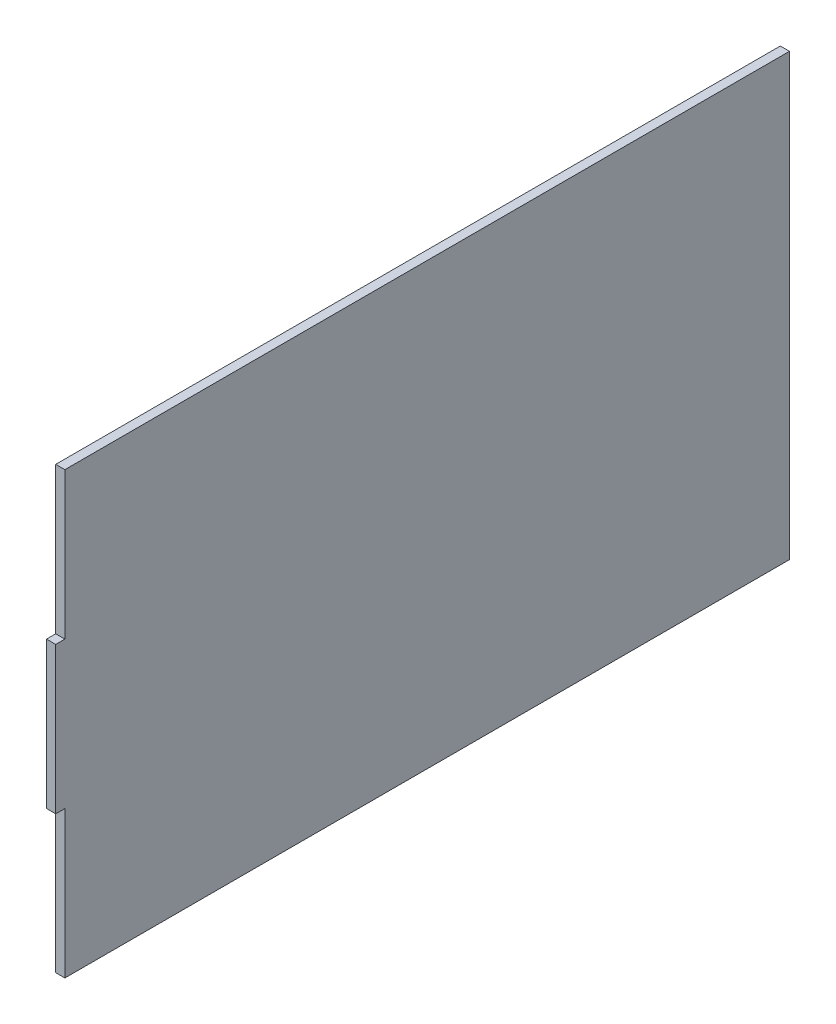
ISO-10303-21;
HEADER;
FILE_DESCRIPTION(('STEP AP214'),'2;1');
FILE_NAME('part.step','',(''),(''),'','','');
FILE_SCHEMA(('AUTOMOTIVE_DESIGN { 1 0 10303 214 1 1 1 1 }'));
ENDSEC;
DATA;
#1=APPLICATION_CONTEXT('core data for automotive mechanical design processes');
#2=APPLICATION_PROTOCOL_DEFINITION('international standard','automotive_design',2000,#1);
#3=PRODUCT_CONTEXT('',#1,'mechanical');
#4=PRODUCT('Part','Part','',(#3));
#5=PRODUCT_RELATED_PRODUCT_CATEGORY('part','',(#4));
#6=PRODUCT_DEFINITION_FORMATION('','',#4);
#7=PRODUCT_DEFINITION_CONTEXT('part definition',#1,'design');
#8=PRODUCT_DEFINITION('design','',#6,#7);
#9=PRODUCT_DEFINITION_SHAPE('','',#8);
#10=(LENGTH_UNIT() NAMED_UNIT(*) SI_UNIT(.MILLI.,.METRE.));
#11=(NAMED_UNIT(*) PLANE_ANGLE_UNIT() SI_UNIT($,.RADIAN.));
#12=(NAMED_UNIT(*) SI_UNIT($,.STERADIAN.) SOLID_ANGLE_UNIT());
#13=UNCERTAINTY_MEASURE_WITH_UNIT(LENGTH_MEASURE(1.E-05),#10,'distance_accuracy_value','');
#14=(GEOMETRIC_REPRESENTATION_CONTEXT(3) GLOBAL_UNCERTAINTY_ASSIGNED_CONTEXT((#13)) GLOBAL_UNIT_ASSIGNED_CONTEXT((#10,
#11,#12)) REPRESENTATION_CONTEXT('',''));
#15=CARTESIAN_POINT('',(0.,0.,0.));
#16=DIRECTION('',(0.,0.,1.));
#17=DIRECTION('',(1.,0.,0.));
#18=AXIS2_PLACEMENT_3D('',#15,#16,#17);
#19=CARTESIAN_POINT('',(1.58749999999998,152.4,-127.));
#20=DIRECTION('',(-1.,0.,0.));
#21=DIRECTION('',(0.,0.,1.));
#22=AXIS2_PLACEMENT_3D('',#19,#20,#21);
#23=PLANE('',#22);
#24=DIRECTION('',(0.,-1.,0.));
#25=VECTOR('',#24,1.);
#26=CARTESIAN_POINT('',(1.58750000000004,152.4,123.825));
#27=LINE('',#26,#25);
#28=CARTESIAN_POINT('',(1.58750000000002,152.4,123.825));
#29=VERTEX_POINT('',#28);
#30=CARTESIAN_POINT('',(1.58750000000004,101.6,123.825));
#31=VERTEX_POINT('',#30);
#32=EDGE_CURVE('E49',#29,#31,#27,.T.);
#33=ORIENTED_EDGE('',*,*,#32,.T.);
#34=DIRECTION('',(0.,0.,1.));
#35=VECTOR('',#34,1.);
#36=CARTESIAN_POINT('',(1.58750000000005,101.6,127.));
#37=LINE('',#36,#35);
#38=CARTESIAN_POINT('',(1.58750000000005,101.6,127.));
#39=VERTEX_POINT('',#38);
#40=EDGE_CURVE('E132',#31,#39,#37,.T.);
#41=ORIENTED_EDGE('',*,*,#40,.T.);
#42=DIRECTION('',(0.,-1.,0.));
#43=VECTOR('',#42,1.);
#44=CARTESIAN_POINT('',(1.58750000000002,152.4,127.));
#45=LINE('',#44,#43);
#46=CARTESIAN_POINT('',(1.58750000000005,50.8,127.));
#47=VERTEX_POINT('',#46);
#48=EDGE_CURVE('E202',#39,#47,#45,.T.);
#49=ORIENTED_EDGE('',*,*,#48,.T.);
#50=DIRECTION('',(0.,0.,-1.));
#51=VECTOR('',#50,1.);
#52=CARTESIAN_POINT('',(1.58750000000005,50.8,127.));
#53=LINE('',#52,#51);
#54=CARTESIAN_POINT('',(1.58750000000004,50.8,123.825));
#55=VERTEX_POINT('',#54);
#56=EDGE_CURVE('E151',#47,#55,#53,.T.);
#57=ORIENTED_EDGE('',*,*,#56,.T.);
#58=DIRECTION('',(0.,-1.,0.));
#59=VECTOR('',#58,1.);
#60=CARTESIAN_POINT('',(1.58750000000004,0.,123.825));
#61=LINE('',#60,#59);
#62=CARTESIAN_POINT('',(1.58750000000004,0.,123.825));
#63=VERTEX_POINT('',#62);
#64=EDGE_CURVE('E154',#55,#63,#61,.T.);
#65=ORIENTED_EDGE('',*,*,#64,.T.);
#66=DIRECTION('',(0.,0.,-1.));
#67=VECTOR('',#66,1.);
#68=CARTESIAN_POINT('',(1.58749999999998,0.,-127.));
#69=LINE('',#68,#67);
#70=CARTESIAN_POINT('',(1.58749999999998,0.,-127.));
#71=VERTEX_POINT('',#70);
#72=EDGE_CURVE('E189',#63,#71,#69,.T.);
#73=ORIENTED_EDGE('',*,*,#72,.T.);
#74=DIRECTION('',(0.,-1.,0.));
#75=VECTOR('',#74,1.);
#76=CARTESIAN_POINT('',(1.58749999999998,152.4,-127.));
#77=LINE('',#76,#75);
#78=CARTESIAN_POINT('',(1.58749999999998,152.4,-127.));
#79=VERTEX_POINT('',#78);
#80=EDGE_CURVE('E11',#79,#71,#77,.T.);
#81=ORIENTED_EDGE('',*,*,#80,.F.);
#82=DIRECTION('',(0.,0.,-1.));
#83=VECTOR('',#82,1.);
#84=CARTESIAN_POINT('',(1.58749999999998,152.4,-127.));
#85=LINE('',#84,#83);
#86=EDGE_CURVE('E141',#29,#79,#85,.T.);
#87=ORIENTED_EDGE('',*,*,#86,.F.);
#88=EDGE_LOOP('',(#33,#41,#49,#57,#65,#73,#81,#87));
#89=FACE_BOUND('',#88,.T.);
#90=ADVANCED_FACE('F35',(#89),#23,.F.);
#91=CARTESIAN_POINT('',(-1.58750000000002,152.4,-127.));
#92=DIRECTION('',(0.,0.,1.));
#93=DIRECTION('',(1.,0.,0.));
#94=AXIS2_PLACEMENT_3D('',#91,#92,#93);
#95=PLANE('',#94);
#96=DIRECTION('',(0.,-1.,0.));
#97=VECTOR('',#96,1.);
#98=CARTESIAN_POINT('',(0.,63.5,-127.));
#99=LINE('',#98,#97);
#100=CARTESIAN_POINT('',(0.,63.5,-127.));
#101=VERTEX_POINT('',#100);
#102=CARTESIAN_POINT('',(0.,38.1,-127.));
#103=VERTEX_POINT('',#102);
#104=EDGE_CURVE('E166',#101,#103,#99,.T.);
#105=ORIENTED_EDGE('',*,*,#104,.F.);
#106=DIRECTION('',(-1.,0.,0.));
#107=VECTOR('',#106,1.);
#108=CARTESIAN_POINT('',(0.,63.5,-127.));
#109=LINE('',#108,#107);
#110=CARTESIAN_POINT('',(-1.58750000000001,63.5,-127.));
#111=VERTEX_POINT('',#110);
#112=EDGE_CURVE('E186',#101,#111,#109,.T.);
#113=ORIENTED_EDGE('',*,*,#112,.T.);
#114=DIRECTION('',(0.,-1.,0.));
#115=VECTOR('',#114,1.);
#116=CARTESIAN_POINT('',(-1.58750000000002,152.4,-127.));
#117=LINE('',#116,#115);
#118=CARTESIAN_POINT('',(-1.58750000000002,152.4,-127.));
#119=VERTEX_POINT('',#118);
#120=EDGE_CURVE('E42',#119,#111,#117,.T.);
#121=ORIENTED_EDGE('',*,*,#120,.F.);
#122=DIRECTION('',(-1.,0.,0.));
#123=VECTOR('',#122,1.);
#124=CARTESIAN_POINT('',(-1.58750000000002,152.4,-127.));
#125=LINE('',#124,#123);
#126=EDGE_CURVE('E196',#79,#119,#125,.T.);
#127=ORIENTED_EDGE('',*,*,#126,.F.);
#128=ORIENTED_EDGE('',*,*,#80,.T.);
#129=DIRECTION('',(-1.,0.,0.));
#130=VECTOR('',#129,1.);
#131=CARTESIAN_POINT('',(-1.58750000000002,0.,-127.));
#132=LINE('',#131,#130);
#133=CARTESIAN_POINT('',(-1.58750000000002,0.,-127.));
#134=VERTEX_POINT('',#133);
#135=EDGE_CURVE('E204',#71,#134,#132,.T.);
#136=ORIENTED_EDGE('',*,*,#135,.T.);
#137=CARTESIAN_POINT('',(-1.58750000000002,38.1,-127.));
#138=VERTEX_POINT('',#137);
#139=EDGE_CURVE('E212',#138,#134,#117,.T.);
#140=ORIENTED_EDGE('',*,*,#139,.F.);
#141=DIRECTION('',(-1.,0.,0.));
#142=VECTOR('',#141,1.);
#143=CARTESIAN_POINT('',(0.,38.1,-127.));
#144=LINE('',#143,#142);
#145=EDGE_CURVE('E179',#103,#138,#144,.T.);
#146=ORIENTED_EDGE('',*,*,#145,.F.);
#147=EDGE_LOOP('',(#105,#113,#121,#127,#128,#136,#140,#146));
#148=FACE_BOUND('',#147,.T.);
#149=ADVANCED_FACE('F228',(#148),#95,.F.);
#150=CARTESIAN_POINT('',(-1.58750000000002,152.4,-127.));
#151=DIRECTION('',(1.,0.,0.));
#152=DIRECTION('',(0.,0.,-1.));
#153=AXIS2_PLACEMENT_3D('',#150,#151,#152);
#154=PLANE('',#153);
#155=DIRECTION('',(0.,-1.,0.));
#156=VECTOR('',#155,1.);
#157=CARTESIAN_POINT('',(-1.58749999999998,152.4,127.));
#158=LINE('',#157,#156);
#159=CARTESIAN_POINT('',(-1.58749999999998,101.6,127.));
#160=VERTEX_POINT('',#159);
#161=CARTESIAN_POINT('',(-1.58749999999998,50.8,127.));
#162=VERTEX_POINT('',#161);
#163=EDGE_CURVE('E210',#160,#162,#158,.T.);
#164=ORIENTED_EDGE('',*,*,#163,.F.);
#165=DIRECTION('',(0.,0.,1.));
#166=VECTOR('',#165,1.);
#167=CARTESIAN_POINT('',(-1.58749999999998,101.6,127.));
#168=LINE('',#167,#166);
#169=CARTESIAN_POINT('',(-1.58749999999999,101.6,123.825));
#170=VERTEX_POINT('',#169);
#171=EDGE_CURVE('E142',#170,#160,#168,.T.);
#172=ORIENTED_EDGE('',*,*,#171,.F.);
#173=DIRECTION('',(0.,-1.,0.));
#174=VECTOR('',#173,1.);
#175=CARTESIAN_POINT('',(-1.58749999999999,152.4,123.825));
#176=LINE('',#175,#174);
#177=CARTESIAN_POINT('',(-1.58749999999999,152.4,123.825));
#178=VERTEX_POINT('',#177);
#179=EDGE_CURVE('E125',#178,#170,#176,.T.);
#180=ORIENTED_EDGE('',*,*,#179,.F.);
#181=DIRECTION('',(0.,0.,1.));
#182=VECTOR('',#181,1.);
#183=CARTESIAN_POINT('',(-1.58750000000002,152.4,-127.));
#184=LINE('',#183,#182);
#185=EDGE_CURVE('E199',#119,#178,#184,.T.);
#186=ORIENTED_EDGE('',*,*,#185,.F.);
#187=ORIENTED_EDGE('',*,*,#120,.T.);
#188=DIRECTION('',(0.,0.,-1.));
#189=VECTOR('',#188,1.);
#190=CARTESIAN_POINT('',(-1.58750000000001,63.5,-127.));
#191=LINE('',#190,#189);
#192=CARTESIAN_POINT('',(-1.58749999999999,63.5000000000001,117.475));
#193=VERTEX_POINT('',#192);
#194=EDGE_CURVE('E170',#193,#111,#191,.T.);
#195=ORIENTED_EDGE('',*,*,#194,.F.);
#196=DIRECTION('',(0.,1.,0.));
#197=VECTOR('',#196,1.);
#198=CARTESIAN_POINT('',(-1.58749999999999,63.5000000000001,117.475));
#199=LINE('',#198,#197);
#200=CARTESIAN_POINT('',(-1.58749999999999,38.1,117.475));
#201=VERTEX_POINT('',#200);
#202=EDGE_CURVE('E182',#201,#193,#199,.T.);
#203=ORIENTED_EDGE('',*,*,#202,.F.);
#204=DIRECTION('',(0.,0.,1.));
#205=VECTOR('',#204,1.);
#206=CARTESIAN_POINT('',(-1.58750000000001,38.1,-127.));
#207=LINE('',#206,#205);
#208=EDGE_CURVE('E148',#138,#201,#207,.T.);
#209=ORIENTED_EDGE('',*,*,#208,.F.);
#210=ORIENTED_EDGE('',*,*,#139,.T.);
#211=DIRECTION('',(0.,0.,1.));
#212=VECTOR('',#211,1.);
#213=CARTESIAN_POINT('',(-1.58750000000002,0.,-127.));
#214=LINE('',#213,#212);
#215=CARTESIAN_POINT('',(-1.58749999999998,0.,123.825));
#216=VERTEX_POINT('',#215);
#217=EDGE_CURVE('E197',#134,#216,#214,.T.);
#218=ORIENTED_EDGE('',*,*,#217,.T.);
#219=DIRECTION('',(0.,-1.,0.));
#220=VECTOR('',#219,1.);
#221=CARTESIAN_POINT('',(-1.58749999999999,0.,123.825));
#222=LINE('',#221,#220);
#223=CARTESIAN_POINT('',(-1.58749999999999,50.8,123.825));
#224=VERTEX_POINT('',#223);
#225=EDGE_CURVE('E57',#224,#216,#222,.T.);
#226=ORIENTED_EDGE('',*,*,#225,.F.);
#227=DIRECTION('',(0.,0.,-1.));
#228=VECTOR('',#227,1.);
#229=CARTESIAN_POINT('',(-1.58749999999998,50.8,127.));
#230=LINE('',#229,#228);
#231=EDGE_CURVE('E158',#162,#224,#230,.T.);
#232=ORIENTED_EDGE('',*,*,#231,.F.);
#233=EDGE_LOOP('',(#164,#172,#180,#186,#187,#195,#203,#209,#210,#218,#226,#232));
#234=FACE_BOUND('',#233,.T.);
#235=ADVANCED_FACE('F221',(#234),#154,.F.);
#236=CARTESIAN_POINT('',(-1.58749999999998,152.4,127.));
#237=DIRECTION('',(0.,0.,-1.));
#238=DIRECTION('',(-1.,0.,0.));
#239=AXIS2_PLACEMENT_3D('',#236,#237,#238);
#240=PLANE('',#239);
#241=ORIENTED_EDGE('',*,*,#48,.F.);
#242=DIRECTION('',(-1.,0.,0.));
#243=VECTOR('',#242,1.);
#244=CARTESIAN_POINT('',(1.58750000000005,101.6,127.));
#245=LINE('',#244,#243);
#246=EDGE_CURVE('E128',#39,#160,#245,.T.);
#247=ORIENTED_EDGE('',*,*,#246,.T.);
#248=ORIENTED_EDGE('',*,*,#163,.T.);
#249=DIRECTION('',(-1.,0.,0.));
#250=VECTOR('',#249,1.);
#251=CARTESIAN_POINT('',(1.58750000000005,50.8,127.));
#252=LINE('',#251,#250);
#253=EDGE_CURVE('E157',#47,#162,#252,.T.);
#254=ORIENTED_EDGE('',*,*,#253,.F.);
#255=EDGE_LOOP('',(#241,#247,#248,#254));
#256=FACE_BOUND('',#255,.T.);
#257=ADVANCED_FACE('F240',(#256),#240,.F.);
#258=CARTESIAN_POINT('',(0.,152.4,0.));
#259=DIRECTION('',(0.,1.,0.));
#260=DIRECTION('',(0.,0.,1.));
#261=AXIS2_PLACEMENT_3D('',#258,#259,#260);
#262=PLANE('',#261);
#263=DIRECTION('',(-1.,0.,0.));
#264=VECTOR('',#263,1.);
#265=CARTESIAN_POINT('',(1.58750000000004,152.4,123.825));
#266=LINE('',#265,#264);
#267=EDGE_CURVE('E129',#29,#178,#266,.T.);
#268=ORIENTED_EDGE('',*,*,#267,.F.);
#269=ORIENTED_EDGE('',*,*,#86,.T.);
#270=ORIENTED_EDGE('',*,*,#126,.T.);
#271=ORIENTED_EDGE('',*,*,#185,.T.);
#272=EDGE_LOOP('',(#268,#269,#270,#271));
#273=FACE_BOUND('',#272,.T.);
#274=ADVANCED_FACE('F242',(#273),#262,.T.);
#275=CARTESIAN_POINT('',(0.,0.,0.));
#276=DIRECTION('',(0.,1.,0.));
#277=DIRECTION('',(0.,0.,1.));
#278=AXIS2_PLACEMENT_3D('',#275,#276,#277);
#279=PLANE('',#278);
#280=ORIENTED_EDGE('',*,*,#72,.F.);
#281=DIRECTION('',(-1.,0.,0.));
#282=VECTOR('',#281,1.);
#283=CARTESIAN_POINT('',(1.58750000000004,0.,123.825));
#284=LINE('',#283,#282);
#285=EDGE_CURVE('E146',#63,#216,#284,.T.);
#286=ORIENTED_EDGE('',*,*,#285,.T.);
#287=ORIENTED_EDGE('',*,*,#217,.F.);
#288=ORIENTED_EDGE('',*,*,#135,.F.);
#289=EDGE_LOOP('',(#280,#286,#287,#288));
#290=FACE_BOUND('',#289,.T.);
#291=ADVANCED_FACE('F232',(#290),#279,.F.);
#292=CARTESIAN_POINT('',(0.,63.5,-127.));
#293=DIRECTION('',(0.,1.,0.));
#294=DIRECTION('',(0.,0.,1.));
#295=AXIS2_PLACEMENT_3D('',#292,#293,#294);
#296=PLANE('',#295);
#297=ORIENTED_EDGE('',*,*,#194,.T.);
#298=ORIENTED_EDGE('',*,*,#112,.F.);
#299=DIRECTION('',(0.,0.,-1.));
#300=VECTOR('',#299,1.);
#301=CARTESIAN_POINT('',(0.,63.5,-127.));
#302=LINE('',#301,#300);
#303=CARTESIAN_POINT('',(0.,63.5000000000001,117.475));
#304=VERTEX_POINT('',#303);
#305=EDGE_CURVE('E176',#304,#101,#302,.T.);
#306=ORIENTED_EDGE('',*,*,#305,.F.);
#307=DIRECTION('',(-1.,0.,0.));
#308=VECTOR('',#307,1.);
#309=CARTESIAN_POINT('',(0.,63.5000000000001,117.475));
#310=LINE('',#309,#308);
#311=EDGE_CURVE('E190',#304,#193,#310,.T.);
#312=ORIENTED_EDGE('',*,*,#311,.T.);
#313=EDGE_LOOP('',(#297,#298,#306,#312));
#314=FACE_BOUND('',#313,.T.);
#315=ADVANCED_FACE('F245',(#314),#296,.F.);
#316=CARTESIAN_POINT('',(0.,63.5000000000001,117.475));
#317=DIRECTION('',(0.,0.,1.));
#318=DIRECTION('',(1.,0.,0.));
#319=AXIS2_PLACEMENT_3D('',#316,#317,#318);
#320=PLANE('',#319);
#321=ORIENTED_EDGE('',*,*,#202,.T.);
#322=ORIENTED_EDGE('',*,*,#311,.F.);
#323=DIRECTION('',(0.,1.,0.));
#324=VECTOR('',#323,1.);
#325=CARTESIAN_POINT('',(0.,63.5000000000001,117.475));
#326=LINE('',#325,#324);
#327=CARTESIAN_POINT('',(0.,38.1,117.475));
#328=VERTEX_POINT('',#327);
#329=EDGE_CURVE('E173',#328,#304,#326,.T.);
#330=ORIENTED_EDGE('',*,*,#329,.F.);
#331=DIRECTION('',(-1.,0.,0.));
#332=VECTOR('',#331,1.);
#333=CARTESIAN_POINT('',(0.,38.1,117.475));
#334=LINE('',#333,#332);
#335=EDGE_CURVE('E192',#328,#201,#334,.T.);
#336=ORIENTED_EDGE('',*,*,#335,.T.);
#337=EDGE_LOOP('',(#321,#322,#330,#336));
#338=FACE_BOUND('',#337,.T.);
#339=ADVANCED_FACE('F250',(#338),#320,.F.);
#340=CARTESIAN_POINT('',(0.,38.1,-127.));
#341=DIRECTION('',(0.,-1.,0.));
#342=DIRECTION('',(0.,0.,-1.));
#343=AXIS2_PLACEMENT_3D('',#340,#341,#342);
#344=PLANE('',#343);
#345=ORIENTED_EDGE('',*,*,#208,.T.);
#346=ORIENTED_EDGE('',*,*,#335,.F.);
#347=DIRECTION('',(0.,0.,1.));
#348=VECTOR('',#347,1.);
#349=CARTESIAN_POINT('',(0.,38.1,-127.));
#350=LINE('',#349,#348);
#351=EDGE_CURVE('E169',#103,#328,#350,.T.);
#352=ORIENTED_EDGE('',*,*,#351,.F.);
#353=ORIENTED_EDGE('',*,*,#145,.T.);
#354=EDGE_LOOP('',(#345,#346,#352,#353));
#355=FACE_BOUND('',#354,.T.);
#356=ADVANCED_FACE('F252',(#355),#344,.F.);
#357=CARTESIAN_POINT('',(0.,0.,0.));
#358=DIRECTION('',(-1.,0.,0.));
#359=DIRECTION('',(0.,0.,1.));
#360=AXIS2_PLACEMENT_3D('',#357,#358,#359);
#361=PLANE('',#360);
#362=ORIENTED_EDGE('',*,*,#104,.T.);
#363=ORIENTED_EDGE('',*,*,#351,.T.);
#364=ORIENTED_EDGE('',*,*,#329,.T.);
#365=ORIENTED_EDGE('',*,*,#305,.T.);
#366=EDGE_LOOP('',(#362,#363,#364,#365));
#367=FACE_BOUND('',#366,.T.);
#368=ADVANCED_FACE('F247',(#367),#361,.T.);
#369=CARTESIAN_POINT('',(1.58750000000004,0.,123.825));
#370=DIRECTION('',(0.,0.,-1.));
#371=DIRECTION('',(-1.,0.,0.));
#372=AXIS2_PLACEMENT_3D('',#369,#370,#371);
#373=PLANE('',#372);
#374=ORIENTED_EDGE('',*,*,#225,.T.);
#375=ORIENTED_EDGE('',*,*,#285,.F.);
#376=ORIENTED_EDGE('',*,*,#64,.F.);
#377=DIRECTION('',(-1.,0.,0.));
#378=VECTOR('',#377,1.);
#379=CARTESIAN_POINT('',(1.58750000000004,50.8,123.825));
#380=LINE('',#379,#378);
#381=EDGE_CURVE('E163',#55,#224,#380,.T.);
#382=ORIENTED_EDGE('',*,*,#381,.T.);
#383=EDGE_LOOP('',(#374,#375,#376,#382));
#384=FACE_BOUND('',#383,.T.);
#385=ADVANCED_FACE('F234',(#384),#373,.F.);
#386=CARTESIAN_POINT('',(1.58750000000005,50.8,127.));
#387=DIRECTION('',(0.,1.,0.));
#388=DIRECTION('',(0.,0.,1.));
#389=AXIS2_PLACEMENT_3D('',#386,#387,#388);
#390=PLANE('',#389);
#391=ORIENTED_EDGE('',*,*,#231,.T.);
#392=ORIENTED_EDGE('',*,*,#381,.F.);
#393=ORIENTED_EDGE('',*,*,#56,.F.);
#394=ORIENTED_EDGE('',*,*,#253,.T.);
#395=EDGE_LOOP('',(#391,#392,#393,#394));
#396=FACE_BOUND('',#395,.T.);
#397=ADVANCED_FACE('F237',(#396),#390,.F.);
#398=CARTESIAN_POINT('',(1.58750000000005,101.6,127.));
#399=DIRECTION('',(0.,-1.,0.));
#400=DIRECTION('',(0.,0.,-1.));
#401=AXIS2_PLACEMENT_3D('',#398,#399,#400);
#402=PLANE('',#401);
#403=ORIENTED_EDGE('',*,*,#171,.T.);
#404=ORIENTED_EDGE('',*,*,#246,.F.);
#405=ORIENTED_EDGE('',*,*,#40,.F.);
#406=DIRECTION('',(-1.,0.,0.));
#407=VECTOR('',#406,1.);
#408=CARTESIAN_POINT('',(1.58750000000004,101.6,123.825));
#409=LINE('',#408,#407);
#410=EDGE_CURVE('E121',#31,#170,#409,.T.);
#411=ORIENTED_EDGE('',*,*,#410,.T.);
#412=EDGE_LOOP('',(#403,#404,#405,#411));
#413=FACE_BOUND('',#412,.T.);
#414=ADVANCED_FACE('F133',(#413),#402,.F.);
#415=CARTESIAN_POINT('',(1.58750000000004,152.4,123.825));
#416=DIRECTION('',(0.,0.,-1.));
#417=DIRECTION('',(-1.,0.,0.));
#418=AXIS2_PLACEMENT_3D('',#415,#416,#417);
#419=PLANE('',#418);
#420=ORIENTED_EDGE('',*,*,#179,.T.);
#421=ORIENTED_EDGE('',*,*,#410,.F.);
#422=ORIENTED_EDGE('',*,*,#32,.F.);
#423=ORIENTED_EDGE('',*,*,#267,.T.);
#424=EDGE_LOOP('',(#420,#421,#422,#423));
#425=FACE_BOUND('',#424,.T.);
#426=ADVANCED_FACE('F123',(#425),#419,.F.);
#427=CLOSED_SHELL('',(#90,#149,#235,#257,#274,#291,#315,#339,#356,#368,#385,#397,#414,#426));
#428=MANIFOLD_SOLID_BREP('B2',#427);
#429=ADVANCED_BREP_SHAPE_REPRESENTATION('',(#18,#428),#14);
#430=SHAPE_DEFINITION_REPRESENTATION(#9,#429);
ENDSEC;
END-ISO-10303-21;
